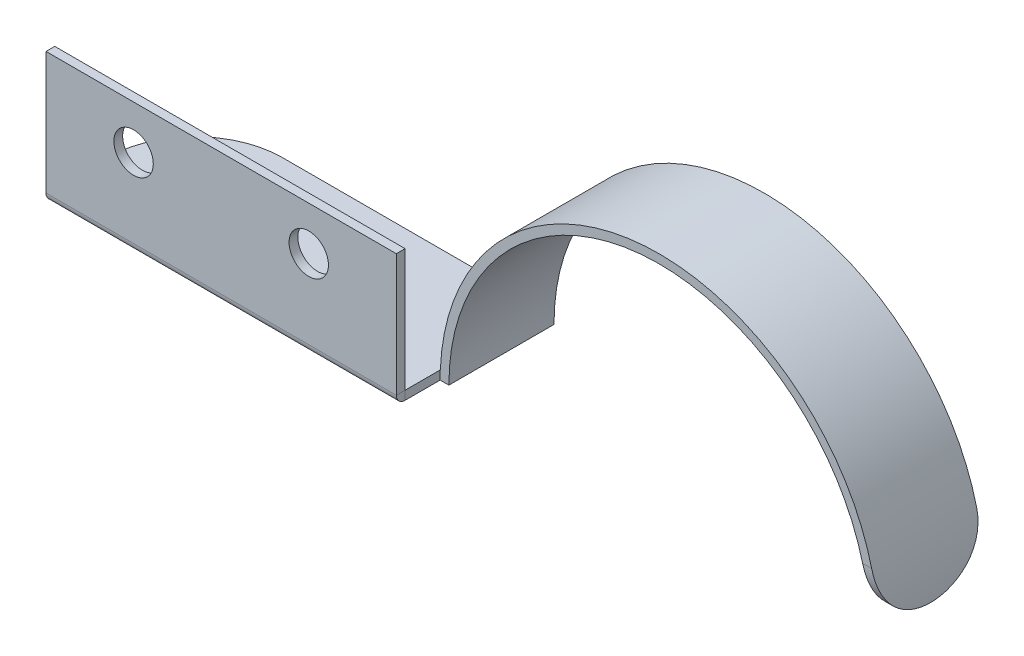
ISO-10303-21;
HEADER;
FILE_DESCRIPTION(('STEP AP214'),'2;1');
FILE_NAME('part.step','',(''),(''),'','','');
FILE_SCHEMA(('AUTOMOTIVE_DESIGN { 1 0 10303 214 1 1 1 1 }'));
ENDSEC;
DATA;
#1=APPLICATION_CONTEXT('core data for automotive mechanical design processes');
#2=APPLICATION_PROTOCOL_DEFINITION('international standard','automotive_design',2000,#1);
#3=PRODUCT_CONTEXT('',#1,'mechanical');
#4=PRODUCT('Part','Part','',(#3));
#5=PRODUCT_RELATED_PRODUCT_CATEGORY('part','',(#4));
#6=PRODUCT_DEFINITION_FORMATION('','',#4);
#7=PRODUCT_DEFINITION_CONTEXT('part definition',#1,'design');
#8=PRODUCT_DEFINITION('design','',#6,#7);
#9=PRODUCT_DEFINITION_SHAPE('','',#8);
#10=(LENGTH_UNIT() NAMED_UNIT(*) SI_UNIT(.MILLI.,.METRE.));
#11=(NAMED_UNIT(*) PLANE_ANGLE_UNIT() SI_UNIT($,.RADIAN.));
#12=(NAMED_UNIT(*) SI_UNIT($,.STERADIAN.) SOLID_ANGLE_UNIT());
#13=UNCERTAINTY_MEASURE_WITH_UNIT(LENGTH_MEASURE(1.E-05),#10,'distance_accuracy_value','');
#14=(GEOMETRIC_REPRESENTATION_CONTEXT(3) GLOBAL_UNCERTAINTY_ASSIGNED_CONTEXT((#13)) GLOBAL_UNIT_ASSIGNED_CONTEXT((#10,
#11,#12)) REPRESENTATION_CONTEXT('',''));
#15=CARTESIAN_POINT('',(0.,0.,0.));
#16=DIRECTION('',(0.,0.,1.));
#17=DIRECTION('',(1.,0.,0.));
#18=AXIS2_PLACEMENT_3D('',#15,#16,#17);
#19=CARTESIAN_POINT('',(65.,0.,-18.));
#20=DIRECTION('',(0.,0.,-1.));
#21=DIRECTION('',(-1.,0.,0.));
#22=AXIS2_PLACEMENT_3D('',#19,#20,#21);
#23=CYLINDRICAL_SURFACE('',#22,24.);
#24=CARTESIAN_POINT('',(65.,0.,-30.));
#25=DIRECTION('',(0.,0.,-1.));
#26=DIRECTION('',(-1.,0.,0.));
#27=AXIS2_PLACEMENT_3D('',#24,#25,#26);
#28=CIRCLE('',#27,24.);
#29=CARTESIAN_POINT('',(41.,0.,-30.));
#30=VERTEX_POINT('',#29);
#31=CARTESIAN_POINT('',(88.2379000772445,6.,-30.));
#32=VERTEX_POINT('',#31);
#33=EDGE_CURVE('E146',#30,#32,#28,.T.);
#34=ORIENTED_EDGE('',*,*,#33,.T.);
#35=CARTESIAN_POINT('',(88.2379000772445,6.,-18.));
#36=CARTESIAN_POINT('',(88.2799795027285,5.83709419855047,-17.9999809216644));
#37=CARTESIAN_POINT('',(88.3203173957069,5.6737241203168,-18.0066342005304));
#38=CARTESIAN_POINT('',(88.3973374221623,5.34719817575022,-18.0333738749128));
#39=CARTESIAN_POINT('',(88.4340190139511,5.18404234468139,-18.0534622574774));
#40=CARTESIAN_POINT('',(88.5035331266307,4.85917422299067,-18.1071543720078));
#41=CARTESIAN_POINT('',(88.5363665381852,4.69746160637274,-18.140754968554));
#42=CARTESIAN_POINT('',(88.5981223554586,4.37667508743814,-18.2214048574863));
#43=CARTESIAN_POINT('',(88.6270450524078,4.21760098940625,-18.2684531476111));
#44=CARTESIAN_POINT('',(88.6810319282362,3.90310418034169,-18.3758843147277));
#45=CARTESIAN_POINT('',(88.7060909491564,3.7476865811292,-18.4362847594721));
#46=CARTESIAN_POINT('',(88.7524163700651,3.4418949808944,-18.570086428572));
#47=CARTESIAN_POINT('',(88.7736813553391,3.29152287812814,-18.6434924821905));
#48=CARTESIAN_POINT('',(88.8125776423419,2.99719357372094,-18.8027764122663));
#49=CARTESIAN_POINT('',(88.8302116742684,2.85323161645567,-18.8886448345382));
#50=CARTESIAN_POINT('',(88.862123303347,2.57274151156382,-19.0723228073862));
#51=CARTESIAN_POINT('',(88.8764008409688,2.4362134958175,-19.1701325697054));
#52=CARTESIAN_POINT('',(88.9017090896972,2.1737990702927,-19.3753397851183));
#53=CARTESIAN_POINT('',(88.912788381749,2.04777670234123,-19.4825574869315));
#54=CARTESIAN_POINT('',(88.9323448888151,1.80491356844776,-19.7071448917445));
#55=CARTESIAN_POINT('',(88.9408221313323,1.68807270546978,-19.8245144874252));
#56=CARTESIAN_POINT('',(88.9555458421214,1.46437633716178,-20.0686462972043));
#57=CARTESIAN_POINT('',(88.9617912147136,1.35752575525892,-20.1954130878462));
#58=CARTESIAN_POINT('',(88.9724239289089,1.15464831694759,-20.4573997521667));
#59=CARTESIAN_POINT('',(88.9768112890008,1.0586213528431,-20.5926195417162));
#60=CARTESIAN_POINT('',(88.9841275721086,0.877442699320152,-20.8715412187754));
#61=CARTESIAN_POINT('',(88.987046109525,0.792371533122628,-21.0152956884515));
#62=CARTESIAN_POINT('',(88.9917403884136,0.634529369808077,-21.3093562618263));
#63=CARTESIAN_POINT('',(88.9935165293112,0.561754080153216,-21.4596600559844));
#64=CARTESIAN_POINT('',(88.9962569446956,0.429024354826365,-21.7657152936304));
#65=CARTESIAN_POINT('',(88.9972217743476,0.36906117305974,-21.9214629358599));
#66=CARTESIAN_POINT('',(88.9986254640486,0.262324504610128,-22.2373642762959));
#67=CARTESIAN_POINT('',(88.9990644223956,0.215548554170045,-22.3975171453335));
#68=CARTESIAN_POINT('',(88.9997853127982,0.117314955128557,-22.7947030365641));
#69=CARTESIAN_POINT('',(88.9999055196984,0.07337029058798,-23.0336346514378));
#70=CARTESIAN_POINT('',(89.000013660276,0.0147139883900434,-23.5150680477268));
#71=CARTESIAN_POINT('',(89.0000015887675,3.49687230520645E-06,-23.7575699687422));
#72=CARTESIAN_POINT('',(88.9999988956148,-2.43074844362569E-06,-24.1685181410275));
#73=CARTESIAN_POINT('',(89.000002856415,0.0071014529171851,-24.3370015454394));
#74=CARTESIAN_POINT('',(88.9999782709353,0.0354635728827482,-24.672824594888));
#75=CARTESIAN_POINT('',(88.9999497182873,0.0567245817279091,-24.840164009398));
#76=CARTESIAN_POINT('',(88.9997492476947,0.113272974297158,-25.1725560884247));
#77=CARTESIAN_POINT('',(88.9995772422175,0.148568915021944,-25.337607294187));
#78=CARTESIAN_POINT('',(88.998906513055,0.232950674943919,-25.6642109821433));
#79=CARTESIAN_POINT('',(88.9984076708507,0.282041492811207,-25.8257621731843));
#80=CARTESIAN_POINT('',(88.9968366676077,0.393621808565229,-26.1440486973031));
#81=CARTESIAN_POINT('',(88.9957648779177,0.456102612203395,-26.3007870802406));
#82=CARTESIAN_POINT('',(88.9927457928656,0.594060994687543,-26.6084983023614));
#83=CARTESIAN_POINT('',(88.99079816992,0.669543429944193,-26.7594689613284));
#84=CARTESIAN_POINT('',(88.9856821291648,0.832900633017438,-27.0544212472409));
#85=CARTESIAN_POINT('',(88.9825143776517,0.920768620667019,-27.1984066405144));
#86=CARTESIAN_POINT('',(88.9745784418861,1.10833174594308,-27.4785058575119));
#87=CARTESIAN_POINT('',(88.9698095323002,1.20803223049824,-27.6146160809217));
#88=CARTESIAN_POINT('',(88.9582905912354,1.41822340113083,-27.8775742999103));
#89=CARTESIAN_POINT('',(88.9515456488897,1.52868588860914,-28.004445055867));
#90=CARTESIAN_POINT('',(88.9356790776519,1.75973440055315,-28.2483350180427));
#91=CARTESIAN_POINT('',(88.9265585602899,1.88031567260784,-28.3653587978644));
#92=CARTESIAN_POINT('',(88.905556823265,2.13076123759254,-28.5888082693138));
#93=CARTESIAN_POINT('',(88.8936749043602,2.26062787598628,-28.6952312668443));
#94=CARTESIAN_POINT('',(88.8668075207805,2.5285597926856,-28.8966499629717));
#95=CARTESIAN_POINT('',(88.8518232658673,2.66662186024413,-28.9916500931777));
#96=CARTESIAN_POINT('',(88.8186181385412,2.94844880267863,-29.1686983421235));
#97=CARTESIAN_POINT('',(88.8004321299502,3.0921404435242,-29.2508695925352));
#98=CARTESIAN_POINT('',(88.7604960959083,3.38536727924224,-29.4028658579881));
#99=CARTESIAN_POINT('',(88.7387473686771,3.53490033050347,-29.4726953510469));
#100=CARTESIAN_POINT('',(88.6915123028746,3.83873293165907,-29.5996454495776));
#101=CARTESIAN_POINT('',(88.666025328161,3.99303328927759,-29.65676388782));
#102=CARTESIAN_POINT('',(88.6112482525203,4.30512329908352,-29.757979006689));
#103=CARTESIAN_POINT('',(88.5819588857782,4.46291227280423,-29.8020781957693));
#104=CARTESIAN_POINT('',(88.5061373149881,4.8492272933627,-29.8932319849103));
#105=CARTESIAN_POINT('',(88.4576014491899,5.07903474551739,-29.9334248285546));
#106=CARTESIAN_POINT('',(88.3792521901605,5.42444021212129,-29.9734562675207));
#107=CARTESIAN_POINT('',(88.3522318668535,5.53961219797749,-29.9834238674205));
#108=CARTESIAN_POINT('',(88.2963960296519,5.76991986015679,-29.9966952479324));
#109=CARTESIAN_POINT('',(88.2675803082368,5.88505553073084,-29.9999982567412));
#110=CARTESIAN_POINT('',(88.2379000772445,6.,-30.));
#111=B_SPLINE_CURVE_WITH_KNOTS('',3,(#35,#36,#37,#38,#39,#40,#41,#42,#43,#44,#45,#46,#47,#48,
#49,#50,#51,#52,#53,#54,#55,#56,#57,#58,#59,#60,#61,#62,#63,#64,#65,#66,#67,#68,#69,#70,#71,#72,
#73,#74,#75,#76,#77,#78,#79,#80,#81,#82,#83,#84,#85,#86,#87,#88,#89,#90,#91,#92,#93,#94,#95,#96,
#97,#98,#99,#100,#101,#102,#103,#104,#105,#106,#107,#108,#109,#110),.UNSPECIFIED.,.F.,.F.,(4,2,
2,2,2,2,2,2,2,2,2,2,2,2,2,2,2,2,2,2,2,2,2,2,2,2,2,2,2,2,2,2,2,2,2,2,2,4),(0.,0.504637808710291,
1.00935026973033,1.51394568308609,2.01850349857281,2.52372916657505,3.02914283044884,
3.53417506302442,4.03921625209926,4.53612484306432,5.03302818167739,5.53017512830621,
6.02731712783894,6.52792654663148,7.028360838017,7.52845241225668,8.02845049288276,
8.75541069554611,9.48239939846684,9.98774431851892,10.4931882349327,10.9989407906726,
11.5048768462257,12.0104853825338,12.516283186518,13.0218051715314,13.5275564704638,
14.0320165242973,14.5362409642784,15.0405932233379,15.5447491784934,16.0437212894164,
16.5425119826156,17.0413876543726,17.5401671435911,18.2531169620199,18.6091060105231,
18.9651362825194),.UNSPECIFIED.);
#112=CARTESIAN_POINT('',(88.2379000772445,6.,-18.));
#113=VERTEX_POINT('',#112);
#114=EDGE_CURVE('E133',#113,#32,#111,.T.);
#115=ORIENTED_EDGE('',*,*,#114,.F.);
#116=CARTESIAN_POINT('',(65.,0.,-18.));
#117=DIRECTION('',(0.,0.,-1.));
#118=DIRECTION('',(-1.,0.,0.));
#119=AXIS2_PLACEMENT_3D('',#116,#117,#118);
#120=CIRCLE('',#119,24.);
#121=CARTESIAN_POINT('',(41.,0.,-18.));
#122=VERTEX_POINT('',#121);
#123=EDGE_CURVE('E257',#122,#113,#120,.T.);
#124=ORIENTED_EDGE('',*,*,#123,.F.);
#125=DIRECTION('',(0.,0.,-1.));
#126=VECTOR('',#125,1.);
#127=CARTESIAN_POINT('',(41.,0.,-18.));
#128=LINE('',#127,#126);
#129=EDGE_CURVE('E150',#122,#30,#128,.T.);
#130=ORIENTED_EDGE('',*,*,#129,.T.);
#131=EDGE_LOOP('',(#34,#115,#124,#130));
#132=FACE_BOUND('',#131,.T.);
#133=ADVANCED_FACE('F40',(#132),#23,.F.);
#134=CARTESIAN_POINT('',(65.,0.,-18.));
#135=DIRECTION('',(0.,0.,-1.));
#136=DIRECTION('',(-1.,0.,0.));
#137=AXIS2_PLACEMENT_3D('',#134,#135,#136);
#138=CYLINDRICAL_SURFACE('',#137,25.);
#139=CARTESIAN_POINT('',(89.2693221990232,6.,-18.));
#140=CARTESIAN_POINT('',(89.3097277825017,5.83663145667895,-17.9999809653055));
#141=CARTESIAN_POINT('',(89.3484559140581,5.67283487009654,-18.0066719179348));
#142=CARTESIAN_POINT('',(89.4223916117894,5.34553304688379,-18.0335455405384));
#143=CARTESIAN_POINT('',(89.4575987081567,5.18202785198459,-18.0537300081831));
#144=CARTESIAN_POINT('',(89.5243068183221,4.85654430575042,-18.1076551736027));
#145=CARTESIAN_POINT('',(89.5558088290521,4.69456555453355,-18.1413922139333));
#146=CARTESIAN_POINT('',(89.615051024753,4.37331960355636,-18.2223410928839));
#147=CARTESIAN_POINT('',(89.6427914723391,4.21405221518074,-18.2695519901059));
#148=CARTESIAN_POINT('',(89.6945610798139,3.89924817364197,-18.377317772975));
#149=CARTESIAN_POINT('',(89.7185855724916,3.74371641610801,-18.4378892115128));
#150=CARTESIAN_POINT('',(89.7629915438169,3.43775460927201,-18.5720344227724));
#151=CARTESIAN_POINT('',(89.7833716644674,3.28732647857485,-18.6456130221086));
#152=CARTESIAN_POINT('',(89.8206410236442,2.99295418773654,-18.8052253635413));
#153=CARTESIAN_POINT('',(89.8375333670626,2.8490043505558,-18.8912479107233));
#154=CARTESIAN_POINT('',(89.8681034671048,2.56852893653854,-19.0752516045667));
#155=CARTESIAN_POINT('',(89.8817801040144,2.4320059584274,-19.1732368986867));
#156=CARTESIAN_POINT('',(89.906031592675,2.16949491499,-19.3788947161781));
#157=CARTESIAN_POINT('',(89.9166500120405,2.04337926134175,-19.4863993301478));
#158=CARTESIAN_POINT('',(89.935386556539,1.80037540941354,-19.7115746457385));
#159=CARTESIAN_POINT('',(89.9435046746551,1.68348723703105,-19.8292453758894));
#160=CARTESIAN_POINT('',(89.957599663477,1.45972542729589,-20.0740072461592));
#161=CARTESIAN_POINT('',(89.9635751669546,1.35285821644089,-20.2011043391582));
#162=CARTESIAN_POINT('',(89.973741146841,1.15002799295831,-20.4637181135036));
#163=CARTESIAN_POINT('',(89.9779322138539,1.05406138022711,-20.5992319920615));
#164=CARTESIAN_POINT('',(89.98491564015,0.873069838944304,-20.8787042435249));
#165=CARTESIAN_POINT('',(89.9876984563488,0.788122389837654,-21.0227130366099));
#166=CARTESIAN_POINT('',(89.9921708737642,0.630560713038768,-21.3172752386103));
#167=CARTESIAN_POINT('',(89.9938608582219,0.557942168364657,-21.4678263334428));
#168=CARTESIAN_POINT('',(89.9964654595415,0.425559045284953,-21.774363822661));
#169=CARTESIAN_POINT('',(89.9973806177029,0.365785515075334,-21.9303463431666));
#170=CARTESIAN_POINT('',(89.9987099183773,0.259459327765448,-22.2467038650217));
#171=CARTESIAN_POINT('',(89.9991241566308,0.212904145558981,-22.4070780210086));
#172=CARTESIAN_POINT('',(89.9997995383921,0.115700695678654,-22.8029461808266));
#173=CARTESIAN_POINT('',(89.9999117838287,0.0723601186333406,-23.0402728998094));
#174=CARTESIAN_POINT('',(90.0000127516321,0.0145109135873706,-23.5184227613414));
#175=CARTESIAN_POINT('',(90.0000014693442,3.37208022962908E-06,-23.7592460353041));
#176=CARTESIAN_POINT('',(89.9999989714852,-2.36039619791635E-06,-24.1685234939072));
#177=CARTESIAN_POINT('',(90.0000027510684,0.00710196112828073,-24.3370130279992));
#178=CARTESIAN_POINT('',(89.9999791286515,0.0354660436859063,-24.6728483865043));
#179=CARTESIAN_POINT('',(89.9999517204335,0.056728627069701,-24.8401939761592));
#180=CARTESIAN_POINT('',(89.9997592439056,0.113281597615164,-25.1726005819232));
#181=CARTESIAN_POINT('',(89.9995940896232,0.148580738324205,-25.3376601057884));
#182=CARTESIAN_POINT('',(89.9989500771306,0.232970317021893,-25.6642799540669));
#183=CARTESIAN_POINT('',(89.998471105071,0.282065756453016,-25.8258389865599));
#184=CARTESIAN_POINT('',(89.9969626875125,0.39365600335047,-26.1441386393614));
#185=CARTESIAN_POINT('',(89.995933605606,0.456141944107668,-26.300882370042));
#186=CARTESIAN_POINT('',(89.993034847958,0.594111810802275,-26.608604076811));
#187=CARTESIAN_POINT('',(89.9911648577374,0.66960059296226,-26.7595798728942));
#188=CARTESIAN_POINT('',(89.9862528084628,0.832971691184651,-27.0545418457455));
#189=CARTESIAN_POINT('',(89.9832113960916,0.920847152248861,-27.1985318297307));
#190=CARTESIAN_POINT('',(89.9755920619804,1.1084278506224,-27.4786414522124));
#191=CARTESIAN_POINT('',(89.9710134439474,1.2081384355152,-27.6147574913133));
#192=CARTESIAN_POINT('',(89.9599531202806,1.41837599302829,-27.8777566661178));
#193=CARTESIAN_POINT('',(89.9534759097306,1.52887701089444,-28.0046607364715));
#194=CARTESIAN_POINT('',(89.9382387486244,1.76001466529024,-28.2486169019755));
#195=CARTESIAN_POINT('',(89.9294798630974,1.88064655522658,-28.365673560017));
#196=CARTESIAN_POINT('',(89.9093101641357,2.13121194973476,-28.5891907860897));
#197=CARTESIAN_POINT('',(89.8978986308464,2.26114797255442,-28.6956484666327));
#198=CARTESIAN_POINT('',(89.8720940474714,2.5292412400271,-28.8971359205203));
#199=CARTESIAN_POINT('',(89.8577021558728,2.66739527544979,-28.9921701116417));
#200=CARTESIAN_POINT('',(89.8257949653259,2.94955369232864,-29.1693584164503));
#201=CARTESIAN_POINT('',(89.8083104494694,3.09349049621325,-29.2516257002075));
#202=CARTESIAN_POINT('',(89.7699100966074,3.38725386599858,-29.4037868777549));
#203=CARTESIAN_POINT('',(89.7489955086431,3.5370782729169,-29.4736852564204));
#204=CARTESIAN_POINT('',(89.7035674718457,3.84154047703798,-29.600737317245));
#205=CARTESIAN_POINT('',(89.6790535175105,3.99617894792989,-29.657889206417));
#206=CARTESIAN_POINT('',(89.6263619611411,4.30900042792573,-29.7591288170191));
#207=CARTESIAN_POINT('',(89.5981850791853,4.46718273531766,-29.8032191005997));
#208=CARTESIAN_POINT('',(89.5255158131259,4.85304070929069,-29.8939380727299));
#209=CARTESIAN_POINT('',(89.4791420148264,5.08199424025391,-29.9338521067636));
#210=CARTESIAN_POINT('',(89.4043040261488,5.42621207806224,-29.9736188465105));
#211=CARTESIAN_POINT('',(89.3784977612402,5.54100452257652,-29.9835237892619));
#212=CARTESIAN_POINT('',(89.3251762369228,5.77058860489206,-29.9967139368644));
#213=CARTESIAN_POINT('',(89.2976607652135,5.88538024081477,-29.9999983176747));
#214=CARTESIAN_POINT('',(89.2693221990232,6.,-30.));
#215=B_SPLINE_CURVE_WITH_KNOTS('',3,(#139,#140,#141,#142,#143,#144,#145,#146,#147,#148,#149,
#150,#151,#152,#153,#154,#155,#156,#157,#158,#159,#160,#161,#162,#163,#164,#165,#166,#167,#168,
#169,#170,#171,#172,#173,#174,#175,#176,#177,#178,#179,#180,#181,#182,#183,#184,#185,#186,#187,
#188,#189,#190,#191,#192,#193,#194,#195,#196,#197,#198,#199,#200,#201,#202,#203,#204,#205,#206,
#207,#208,#209,#210,#211,#212,#213,#214),.UNSPECIFIED.,.F.,.F.,(4,2,2,2,2,2,2,2,2,2,2,2,2,2,2,2,
2,2,2,2,2,2,2,2,2,2,2,2,2,2,2,2,2,2,2,2,2,4),(0.,0.504750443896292,1.00956814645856,
1.51424970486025,2.01889601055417,2.5241710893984,3.02963405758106,3.53464509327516,
4.03983171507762,4.53741836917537,5.03500641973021,5.5329114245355,6.03065150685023,
6.53172083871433,7.03261435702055,7.53315765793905,8.03360527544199,8.75554256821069,
9.47750706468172,9.98286937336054,10.4883324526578,10.9941112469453,11.5000736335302,
12.0057020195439,12.5115196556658,13.0170584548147,13.5228265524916,14.0274067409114,
14.5317518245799,15.0362339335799,15.5405203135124,16.0400439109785,16.5393860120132,
17.0387983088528,17.5381125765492,18.2471859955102,18.6012429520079,18.9553439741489),.UNSPECIFIED.);
#216=CARTESIAN_POINT('',(89.2693221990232,6.,-18.));
#217=VERTEX_POINT('',#216);
#218=CARTESIAN_POINT('',(89.2693221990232,6.,-30.));
#219=VERTEX_POINT('',#218);
#220=EDGE_CURVE('E54',#217,#219,#215,.T.);
#221=ORIENTED_EDGE('',*,*,#220,.T.);
#222=CARTESIAN_POINT('',(65.,0.,-30.));
#223=DIRECTION('',(0.,0.,-1.));
#224=DIRECTION('',(-1.,0.,0.));
#225=AXIS2_PLACEMENT_3D('',#222,#223,#224);
#226=CIRCLE('',#225,25.);
#227=CARTESIAN_POINT('',(40.0200080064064,1.,-30.));
#228=VERTEX_POINT('',#227);
#229=EDGE_CURVE('E141',#228,#219,#226,.T.);
#230=ORIENTED_EDGE('',*,*,#229,.F.);
#231=DIRECTION('',(0.,0.,-1.));
#232=VECTOR('',#231,1.);
#233=CARTESIAN_POINT('',(40.0200080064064,1.,-18.));
#234=LINE('',#233,#232);
#235=CARTESIAN_POINT('',(40.0200080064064,1.,-18.));
#236=VERTEX_POINT('',#235);
#237=EDGE_CURVE('E161',#236,#228,#234,.T.);
#238=ORIENTED_EDGE('',*,*,#237,.F.);
#239=CARTESIAN_POINT('',(65.,0.,-18.));
#240=DIRECTION('',(0.,0.,-1.));
#241=DIRECTION('',(-1.,0.,0.));
#242=AXIS2_PLACEMENT_3D('',#239,#240,#241);
#243=CIRCLE('',#242,25.);
#244=EDGE_CURVE('E154',#236,#217,#243,.T.);
#245=ORIENTED_EDGE('',*,*,#244,.T.);
#246=EDGE_LOOP('',(#221,#230,#238,#245));
#247=FACE_BOUND('',#246,.T.);
#248=ADVANCED_FACE('F259',(#247),#138,.T.);
#249=CARTESIAN_POINT('',(10.0000000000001,1.,-30.));
#250=DIRECTION('',(0.,0.,1.));
#251=DIRECTION('',(1.,0.,0.));
#252=AXIS2_PLACEMENT_3D('',#249,#250,#251);
#253=PLANE('',#252);
#254=DIRECTION('',(1.,0.,0.));
#255=VECTOR('',#254,1.);
#256=CARTESIAN_POINT('',(80.,6.,-30.));
#257=LINE('',#256,#255);
#258=EDGE_CURVE('E12',#32,#219,#257,.T.);
#259=ORIENTED_EDGE('',*,*,#258,.F.);
#260=ORIENTED_EDGE('',*,*,#33,.F.);
#261=DIRECTION('',(-1.,0.,0.));
#262=VECTOR('',#261,1.);
#263=CARTESIAN_POINT('',(10.0000000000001,0.,-30.));
#264=LINE('',#263,#262);
#265=CARTESIAN_POINT('',(10.0000000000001,0.,-30.));
#266=VERTEX_POINT('',#265);
#267=EDGE_CURVE('E203',#30,#266,#264,.T.);
#268=ORIENTED_EDGE('',*,*,#267,.T.);
#269=DIRECTION('',(0.,-1.,0.));
#270=VECTOR('',#269,1.);
#271=CARTESIAN_POINT('',(10.0000000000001,1.,-30.));
#272=LINE('',#271,#270);
#273=CARTESIAN_POINT('',(10.0000000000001,1.,-30.));
#274=VERTEX_POINT('',#273);
#275=EDGE_CURVE('E205',#274,#266,#272,.T.);
#276=ORIENTED_EDGE('',*,*,#275,.F.);
#277=DIRECTION('',(-1.,0.,0.));
#278=VECTOR('',#277,1.);
#279=CARTESIAN_POINT('',(10.0000000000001,1.,-30.));
#280=LINE('',#279,#278);
#281=EDGE_CURVE('E193',#228,#274,#280,.T.);
#282=ORIENTED_EDGE('',*,*,#281,.F.);
#283=ORIENTED_EDGE('',*,*,#229,.T.);
#284=EDGE_LOOP('',(#259,#260,#268,#276,#282,#283));
#285=FACE_BOUND('',#284,.T.);
#286=ADVANCED_FACE('F145',(#285),#253,.F.);
#287=CARTESIAN_POINT('',(40.,1.,0.));
#288=DIRECTION('',(-1.,0.,0.));
#289=DIRECTION('',(0.,0.,1.));
#290=AXIS2_PLACEMENT_3D('',#287,#288,#289);
#291=PLANE('',#290);
#292=DIRECTION('',(0.,-1.,0.));
#293=VECTOR('',#292,1.);
#294=CARTESIAN_POINT('',(40.,2.55162453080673,-18.));
#295=LINE('',#294,#293);
#296=CARTESIAN_POINT('',(40.,1.,-18.));
#297=VERTEX_POINT('',#296);
#298=CARTESIAN_POINT('',(40.,0.,-18.));
#299=VERTEX_POINT('',#298);
#300=EDGE_CURVE('E62',#297,#299,#295,.T.);
#301=ORIENTED_EDGE('',*,*,#300,.F.);
#302=DIRECTION('',(0.,0.,-1.));
#303=VECTOR('',#302,1.);
#304=CARTESIAN_POINT('',(40.,1.,0.));
#305=LINE('',#304,#303);
#306=CARTESIAN_POINT('',(40.,1.,-14.));
#307=VERTEX_POINT('',#306);
#308=EDGE_CURVE('E195',#307,#297,#305,.T.);
#309=ORIENTED_EDGE('',*,*,#308,.F.);
#310=DIRECTION('',(0.,-1.,0.));
#311=VECTOR('',#310,1.);
#312=CARTESIAN_POINT('',(40.,0.999999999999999,-14.));
#313=LINE('',#312,#311);
#314=CARTESIAN_POINT('',(40.,0.,-14.));
#315=VERTEX_POINT('',#314);
#316=EDGE_CURVE('E188',#307,#315,#313,.T.);
#317=ORIENTED_EDGE('',*,*,#316,.T.);
#318=DIRECTION('',(0.,0.,-1.));
#319=VECTOR('',#318,1.);
#320=CARTESIAN_POINT('',(40.,0.,0.));
#321=LINE('',#320,#319);
#322=EDGE_CURVE('E186',#315,#299,#321,.T.);
#323=ORIENTED_EDGE('',*,*,#322,.T.);
#324=EDGE_LOOP('',(#301,#309,#317,#323));
#325=FACE_BOUND('',#324,.T.);
#326=ADVANCED_FACE('F280',(#325),#291,.F.);
#327=CARTESIAN_POINT('',(10.,-5.00007278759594,-12.9999));
#328=DIRECTION('',(0.,0.,1.));
#329=DIRECTION('',(0.,-1.,0.));
#330=AXIS2_PLACEMENT_3D('',#327,#328,#329);
#331=PLANE('',#330);
#332=CARTESIAN_POINT('',(10.,9.99992721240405,-12.9999));
#333=DIRECTION('',(0.,0.,-1.));
#334=DIRECTION('',(0.,1.,0.));
#335=AXIS2_PLACEMENT_3D('',#332,#333,#334);
#336=CIRCLE('',#335,2.25);
#337=CARTESIAN_POINT('',(10.,12.2499272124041,-12.9999));
#338=VERTEX_POINT('',#337);
#339=EDGE_CURVE('E214',#338,#338,#336,.T.);
#340=ORIENTED_EDGE('',*,*,#339,.T.);
#341=EDGE_LOOP('',(#340));
#342=FACE_BOUND('',#341,.T.);
#343=CARTESIAN_POINT('',(30.,9.99992721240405,-12.9999));
#344=DIRECTION('',(0.,0.,-1.));
#345=DIRECTION('',(0.,1.,0.));
#346=AXIS2_PLACEMENT_3D('',#343,#344,#345);
#347=CIRCLE('',#346,2.25);
#348=CARTESIAN_POINT('',(30.,12.2499272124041,-12.9999));
#349=VERTEX_POINT('',#348);
#350=EDGE_CURVE('E179',#349,#349,#347,.T.);
#351=ORIENTED_EDGE('',*,*,#350,.T.);
#352=EDGE_LOOP('',(#351));
#353=FACE_BOUND('',#352,.T.);
#354=DIRECTION('',(0.,1.,0.));
#355=VECTOR('',#354,1.);
#356=CARTESIAN_POINT('',(0.,14.9999272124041,-12.9999));
#357=LINE('',#356,#355);
#358=CARTESIAN_POINT('',(0.,1.00010000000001,-12.9999));
#359=VERTEX_POINT('',#358);
#360=CARTESIAN_POINT('',(0.,14.9999272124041,-12.9999));
#361=VERTEX_POINT('',#360);
#362=EDGE_CURVE('E220',#359,#361,#357,.T.);
#363=ORIENTED_EDGE('',*,*,#362,.F.);
#364=DIRECTION('',(1.,0.,0.));
#365=VECTOR('',#364,1.);
#366=CARTESIAN_POINT('',(10.,1.0001,-12.9999));
#367=LINE('',#366,#365);
#368=CARTESIAN_POINT('',(40.,1.0001,-12.9999));
#369=VERTEX_POINT('',#368);
#370=EDGE_CURVE('E242',#359,#369,#367,.T.);
#371=ORIENTED_EDGE('',*,*,#370,.T.);
#372=DIRECTION('',(0.,-1.,0.));
#373=VECTOR('',#372,1.);
#374=CARTESIAN_POINT('',(40.,14.9999272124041,-12.9999));
#375=LINE('',#374,#373);
#376=CARTESIAN_POINT('',(40.,14.9999272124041,-12.9999));
#377=VERTEX_POINT('',#376);
#378=EDGE_CURVE('E229',#377,#369,#375,.T.);
#379=ORIENTED_EDGE('',*,*,#378,.F.);
#380=DIRECTION('',(1.,0.,0.));
#381=VECTOR('',#380,1.);
#382=CARTESIAN_POINT('',(0.,14.9999272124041,-12.9999));
#383=LINE('',#382,#381);
#384=EDGE_CURVE('E227',#361,#377,#383,.T.);
#385=ORIENTED_EDGE('',*,*,#384,.F.);
#386=EDGE_LOOP('',(#363,#371,#379,#385));
#387=FACE_BOUND('',#386,.T.);
#388=ADVANCED_FACE('F355',(#342,#353,#387),#331,.T.);
#389=CARTESIAN_POINT('',(10.,-5.00007278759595,-13.9999));
#390=DIRECTION('',(0.,0.,1.));
#391=DIRECTION('',(0.,-1.,0.));
#392=AXIS2_PLACEMENT_3D('',#389,#390,#391);
#393=PLANE('',#392);
#394=DIRECTION('',(1.,0.,0.));
#395=VECTOR('',#394,1.);
#396=CARTESIAN_POINT('',(10.,1.0001,-13.9999));
#397=LINE('',#396,#395);
#398=CARTESIAN_POINT('',(0.,1.0001,-13.9999));
#399=VERTEX_POINT('',#398);
#400=CARTESIAN_POINT('',(40.,1.0001,-13.9999));
#401=VERTEX_POINT('',#400);
#402=EDGE_CURVE('E236',#399,#401,#397,.T.);
#403=ORIENTED_EDGE('',*,*,#402,.F.);
#404=DIRECTION('',(0.,1.,0.));
#405=VECTOR('',#404,1.);
#406=CARTESIAN_POINT('',(0.,14.9999272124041,-13.9999000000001));
#407=LINE('',#406,#405);
#408=CARTESIAN_POINT('',(0.,14.9999272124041,-13.9999000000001));
#409=VERTEX_POINT('',#408);
#410=EDGE_CURVE('E226',#399,#409,#407,.T.);
#411=ORIENTED_EDGE('',*,*,#410,.T.);
#412=DIRECTION('',(1.,0.,0.));
#413=VECTOR('',#412,1.);
#414=CARTESIAN_POINT('',(0.,14.9999272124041,-13.9999000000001));
#415=LINE('',#414,#413);
#416=CARTESIAN_POINT('',(40.,14.9999272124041,-13.9999000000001));
#417=VERTEX_POINT('',#416);
#418=EDGE_CURVE('E223',#409,#417,#415,.T.);
#419=ORIENTED_EDGE('',*,*,#418,.T.);
#420=DIRECTION('',(0.,-1.,0.));
#421=VECTOR('',#420,1.);
#422=CARTESIAN_POINT('',(40.,14.9999272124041,-13.9999000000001));
#423=LINE('',#422,#421);
#424=EDGE_CURVE('E225',#417,#401,#423,.T.);
#425=ORIENTED_EDGE('',*,*,#424,.T.);
#426=EDGE_LOOP('',(#403,#411,#419,#425));
#427=FACE_BOUND('',#426,.T.);
#428=CARTESIAN_POINT('',(10.,9.99992721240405,-13.9999));
#429=DIRECTION('',(0.,0.,-1.));
#430=DIRECTION('',(0.,1.,0.));
#431=AXIS2_PLACEMENT_3D('',#428,#429,#430);
#432=CIRCLE('',#431,2.25);
#433=CARTESIAN_POINT('',(10.,12.2499272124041,-13.9999));
#434=VERTEX_POINT('',#433);
#435=EDGE_CURVE('E217',#434,#434,#432,.T.);
#436=ORIENTED_EDGE('',*,*,#435,.F.);
#437=EDGE_LOOP('',(#436));
#438=FACE_BOUND('',#437,.T.);
#439=CARTESIAN_POINT('',(30.,9.99992721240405,-13.9999));
#440=DIRECTION('',(0.,0.,-1.));
#441=DIRECTION('',(0.,1.,0.));
#442=AXIS2_PLACEMENT_3D('',#439,#440,#441);
#443=CIRCLE('',#442,2.25);
#444=CARTESIAN_POINT('',(30.,12.2499272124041,-13.9999));
#445=VERTEX_POINT('',#444);
#446=EDGE_CURVE('E211',#445,#445,#443,.T.);
#447=ORIENTED_EDGE('',*,*,#446,.F.);
#448=EDGE_LOOP('',(#447));
#449=FACE_BOUND('',#448,.T.);
#450=ADVANCED_FACE('F289',(#427,#438,#449),#393,.F.);
#451=CARTESIAN_POINT('',(0.,14.9999272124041,-13.9999000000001));
#452=DIRECTION('',(1.,0.,0.));
#453=DIRECTION('',(0.,-1.,0.));
#454=AXIS2_PLACEMENT_3D('',#451,#452,#453);
#455=PLANE('',#454);
#456=DIRECTION('',(0.,0.,-1.));
#457=VECTOR('',#456,1.);
#458=CARTESIAN_POINT('',(0.,1.0001,-13.9999));
#459=LINE('',#458,#457);
#460=EDGE_CURVE('E245',#359,#399,#459,.T.);
#461=ORIENTED_EDGE('',*,*,#460,.F.);
#462=ORIENTED_EDGE('',*,*,#362,.T.);
#463=DIRECTION('',(0.,0.,1.));
#464=VECTOR('',#463,1.);
#465=CARTESIAN_POINT('',(0.,14.9999272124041,-13.9999000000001));
#466=LINE('',#465,#464);
#467=EDGE_CURVE('E233',#409,#361,#466,.T.);
#468=ORIENTED_EDGE('',*,*,#467,.F.);
#469=ORIENTED_EDGE('',*,*,#410,.F.);
#470=EDGE_LOOP('',(#461,#462,#468,#469));
#471=FACE_BOUND('',#470,.T.);
#472=ADVANCED_FACE('F42',(#471),#455,.F.);
#473=CARTESIAN_POINT('',(0.,14.9999272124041,-13.9999000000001));
#474=DIRECTION('',(0.,-1.,0.));
#475=DIRECTION('',(-1.,0.,0.));
#476=AXIS2_PLACEMENT_3D('',#473,#474,#475);
#477=PLANE('',#476);
#478=ORIENTED_EDGE('',*,*,#384,.T.);
#479=DIRECTION('',(0.,0.,1.));
#480=VECTOR('',#479,1.);
#481=CARTESIAN_POINT('',(40.,14.9999272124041,-13.9999000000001));
#482=LINE('',#481,#480);
#483=EDGE_CURVE('E230',#417,#377,#482,.T.);
#484=ORIENTED_EDGE('',*,*,#483,.F.);
#485=ORIENTED_EDGE('',*,*,#418,.F.);
#486=ORIENTED_EDGE('',*,*,#467,.T.);
#487=EDGE_LOOP('',(#478,#484,#485,#486));
#488=FACE_BOUND('',#487,.T.);
#489=ADVANCED_FACE('F369',(#488),#477,.F.);
#490=CARTESIAN_POINT('',(40.,14.9999272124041,-13.9999000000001));
#491=DIRECTION('',(-1.,0.,0.));
#492=DIRECTION('',(0.,1.,0.));
#493=AXIS2_PLACEMENT_3D('',#490,#491,#492);
#494=PLANE('',#493);
#495=DIRECTION('',(0.,0.,1.));
#496=VECTOR('',#495,1.);
#497=CARTESIAN_POINT('',(40.,1.0001,-13.9999));
#498=LINE('',#497,#496);
#499=EDGE_CURVE('E239',#401,#369,#498,.T.);
#500=ORIENTED_EDGE('',*,*,#499,.F.);
#501=ORIENTED_EDGE('',*,*,#424,.F.);
#502=ORIENTED_EDGE('',*,*,#483,.T.);
#503=ORIENTED_EDGE('',*,*,#378,.T.);
#504=EDGE_LOOP('',(#500,#501,#502,#503));
#505=FACE_BOUND('',#504,.T.);
#506=ADVANCED_FACE('F366',(#505),#494,.F.);
#507=CARTESIAN_POINT('',(10.,9.99992721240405,-13.9999));
#508=DIRECTION('',(0.,0.,1.));
#509=DIRECTION('',(0.,-1.,0.));
#510=AXIS2_PLACEMENT_3D('',#507,#508,#509);
#511=CYLINDRICAL_SURFACE('',#510,2.25);
#512=ORIENTED_EDGE('',*,*,#435,.T.);
#513=EDGE_LOOP('',(#512));
#514=FACE_BOUND('',#513,.T.);
#515=ORIENTED_EDGE('',*,*,#339,.F.);
#516=EDGE_LOOP('',(#515));
#517=FACE_BOUND('',#516,.T.);
#518=ADVANCED_FACE('F368',(#514,#517),#511,.F.);
#519=CARTESIAN_POINT('',(30.,9.99992721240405,-13.9999));
#520=DIRECTION('',(0.,0.,1.));
#521=DIRECTION('',(0.,-1.,0.));
#522=AXIS2_PLACEMENT_3D('',#519,#520,#521);
#523=CYLINDRICAL_SURFACE('',#522,2.25);
#524=ORIENTED_EDGE('',*,*,#446,.T.);
#525=EDGE_LOOP('',(#524));
#526=FACE_BOUND('',#525,.T.);
#527=ORIENTED_EDGE('',*,*,#350,.F.);
#528=EDGE_LOOP('',(#527));
#529=FACE_BOUND('',#528,.T.);
#530=ADVANCED_FACE('F349',(#526,#529),#523,.F.);
#531=CARTESIAN_POINT('',(10.,1.,-20.));
#532=DIRECTION('',(0.,-1.,0.));
#533=DIRECTION('',(0.,0.,-1.));
#534=AXIS2_PLACEMENT_3D('',#531,#532,#533);
#535=CYLINDRICAL_SURFACE('',#534,10.);
#536=CARTESIAN_POINT('',(10.,0.,-20.));
#537=DIRECTION('',(0.,1.,0.));
#538=DIRECTION('',(0.,0.,-1.));
#539=AXIS2_PLACEMENT_3D('',#536,#537,#538);
#540=CIRCLE('',#539,10.);
#541=CARTESIAN_POINT('',(0.,0.,-19.9999999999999));
#542=VERTEX_POINT('',#541);
#543=EDGE_CURVE('E208',#266,#542,#540,.T.);
#544=ORIENTED_EDGE('',*,*,#543,.T.);
#545=DIRECTION('',(0.,-1.,0.));
#546=VECTOR('',#545,1.);
#547=CARTESIAN_POINT('',(0.,1.,-19.9999999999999));
#548=LINE('',#547,#546);
#549=CARTESIAN_POINT('',(0.,1.,-19.9999999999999));
#550=VERTEX_POINT('',#549);
#551=EDGE_CURVE('E176',#550,#542,#548,.T.);
#552=ORIENTED_EDGE('',*,*,#551,.F.);
#553=CARTESIAN_POINT('',(10.,1.,-20.));
#554=DIRECTION('',(0.,1.,0.));
#555=DIRECTION('',(0.,0.,-1.));
#556=AXIS2_PLACEMENT_3D('',#553,#554,#555);
#557=CIRCLE('',#556,10.);
#558=EDGE_CURVE('E191',#274,#550,#557,.T.);
#559=ORIENTED_EDGE('',*,*,#558,.F.);
#560=ORIENTED_EDGE('',*,*,#275,.T.);
#561=EDGE_LOOP('',(#544,#552,#559,#560));
#562=FACE_BOUND('',#561,.T.);
#563=ADVANCED_FACE('F274',(#562),#535,.T.);
#564=CARTESIAN_POINT('',(10.,1.,-20.));
#565=DIRECTION('',(0.,-1.,0.));
#566=DIRECTION('',(0.,0.,-1.));
#567=AXIS2_PLACEMENT_3D('',#564,#565,#566);
#568=PLANE('',#567);
#569=DIRECTION('',(0.,0.,1.));
#570=VECTOR('',#569,1.);
#571=CARTESIAN_POINT('',(0.,1.,0.));
#572=LINE('',#571,#570);
#573=CARTESIAN_POINT('',(0.,1.,-14.));
#574=VERTEX_POINT('',#573);
#575=EDGE_CURVE('E200',#550,#574,#572,.T.);
#576=ORIENTED_EDGE('',*,*,#575,.T.);
#577=DIRECTION('',(1.,0.,0.));
#578=VECTOR('',#577,1.);
#579=CARTESIAN_POINT('',(10.,1.,-14.));
#580=LINE('',#579,#578);
#581=EDGE_CURVE('E197',#574,#307,#580,.T.);
#582=ORIENTED_EDGE('',*,*,#581,.T.);
#583=ORIENTED_EDGE('',*,*,#308,.T.);
#584=DIRECTION('',(1.,0.,0.));
#585=VECTOR('',#584,1.);
#586=CARTESIAN_POINT('',(-15.1833080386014,1.0000000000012,-18.));
#587=LINE('',#586,#585);
#588=EDGE_CURVE('E151',#297,#236,#587,.T.);
#589=ORIENTED_EDGE('',*,*,#588,.T.);
#590=ORIENTED_EDGE('',*,*,#237,.T.);
#591=ORIENTED_EDGE('',*,*,#281,.T.);
#592=ORIENTED_EDGE('',*,*,#558,.T.);
#593=EDGE_LOOP('',(#576,#582,#583,#589,#590,#591,#592));
#594=FACE_BOUND('',#593,.T.);
#595=ADVANCED_FACE('F278',(#594),#568,.F.);
#596=CARTESIAN_POINT('',(10.,0.,-20.));
#597=DIRECTION('',(0.,-1.,0.));
#598=DIRECTION('',(0.,0.,-1.));
#599=AXIS2_PLACEMENT_3D('',#596,#597,#598);
#600=PLANE('',#599);
#601=DIRECTION('',(1.,0.,0.));
#602=VECTOR('',#601,1.);
#603=CARTESIAN_POINT('',(10.,0.,-14.));
#604=LINE('',#603,#602);
#605=CARTESIAN_POINT('',(0.,0.,-13.9999999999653));
#606=VERTEX_POINT('',#605);
#607=EDGE_CURVE('E171',#606,#315,#604,.T.);
#608=ORIENTED_EDGE('',*,*,#607,.F.);
#609=DIRECTION('',(0.,0.,1.));
#610=VECTOR('',#609,1.);
#611=CARTESIAN_POINT('',(0.,0.,0.));
#612=LINE('',#611,#610);
#613=EDGE_CURVE('E183',#542,#606,#612,.T.);
#614=ORIENTED_EDGE('',*,*,#613,.F.);
#615=ORIENTED_EDGE('',*,*,#543,.F.);
#616=ORIENTED_EDGE('',*,*,#267,.F.);
#617=ORIENTED_EDGE('',*,*,#129,.F.);
#618=DIRECTION('',(1.,0.,0.));
#619=VECTOR('',#618,1.);
#620=CARTESIAN_POINT('',(-15.1833080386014,0.,-18.));
#621=LINE('',#620,#619);
#622=EDGE_CURVE('E261',#299,#122,#621,.T.);
#623=ORIENTED_EDGE('',*,*,#622,.F.);
#624=ORIENTED_EDGE('',*,*,#322,.F.);
#625=EDGE_LOOP('',(#608,#614,#615,#616,#617,#623,#624));
#626=FACE_BOUND('',#625,.T.);
#627=ADVANCED_FACE('F268',(#626),#600,.T.);
#628=CARTESIAN_POINT('',(0.,1.,0.));
#629=DIRECTION('',(1.,0.,0.));
#630=DIRECTION('',(0.,0.,-1.));
#631=AXIS2_PLACEMENT_3D('',#628,#629,#630);
#632=PLANE('',#631);
#633=ORIENTED_EDGE('',*,*,#613,.T.);
#634=DIRECTION('',(0.,1.,0.));
#635=VECTOR('',#634,1.);
#636=CARTESIAN_POINT('',(0.,0.999999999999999,-14.));
#637=LINE('',#636,#635);
#638=EDGE_CURVE('E180',#606,#574,#637,.T.);
#639=ORIENTED_EDGE('',*,*,#638,.T.);
#640=ORIENTED_EDGE('',*,*,#575,.F.);
#641=ORIENTED_EDGE('',*,*,#551,.T.);
#642=EDGE_LOOP('',(#633,#639,#640,#641));
#643=FACE_BOUND('',#642,.T.);
#644=ADVANCED_FACE('F303',(#643),#632,.F.);
#645=CARTESIAN_POINT('',(0.,1.0001,-14.));
#646=DIRECTION('',(1.,0.,0.));
#647=DIRECTION('',(0.,0.,-1.));
#648=AXIS2_PLACEMENT_3D('',#645,#646,#647);
#649=PLANE('',#648);
#650=ORIENTED_EDGE('',*,*,#638,.F.);
#651=CARTESIAN_POINT('',(0.,1.0001,-14.));
#652=DIRECTION('',(1.,0.,0.));
#653=DIRECTION('',(0.,0.,-1.));
#654=AXIS2_PLACEMENT_3D('',#651,#652,#653);
#655=CIRCLE('',#654,1.0001);
#656=EDGE_CURVE('E160',#606,#359,#655,.F.);
#657=ORIENTED_EDGE('',*,*,#656,.T.);
#658=ORIENTED_EDGE('',*,*,#460,.T.);
#659=CARTESIAN_POINT('',(0.,1.0001,-14.));
#660=DIRECTION('',(-1.,0.,0.));
#661=DIRECTION('',(0.,0.,1.));
#662=AXIS2_PLACEMENT_3D('',#659,#660,#661);
#663=CIRCLE('',#662,9.99999999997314E-05);
#664=EDGE_CURVE('E164',#574,#399,#663,.T.);
#665=ORIENTED_EDGE('',*,*,#664,.F.);
#666=EDGE_LOOP('',(#650,#657,#658,#665));
#667=FACE_BOUND('',#666,.T.);
#668=ADVANCED_FACE('F298',(#667),#649,.F.);
#669=CARTESIAN_POINT('',(40.,1.0001,-14.));
#670=DIRECTION('',(-1.,0.,0.));
#671=DIRECTION('',(0.,0.,1.));
#672=AXIS2_PLACEMENT_3D('',#669,#670,#671);
#673=PLANE('',#672);
#674=ORIENTED_EDGE('',*,*,#499,.T.);
#675=CARTESIAN_POINT('',(40.,1.0001,-14.));
#676=DIRECTION('',(1.,0.,0.));
#677=DIRECTION('',(0.,0.,-1.));
#678=AXIS2_PLACEMENT_3D('',#675,#676,#677);
#679=CIRCLE('',#678,1.0001);
#680=EDGE_CURVE('E168',#369,#315,#679,.T.);
#681=ORIENTED_EDGE('',*,*,#680,.T.);
#682=ORIENTED_EDGE('',*,*,#316,.F.);
#683=CARTESIAN_POINT('',(40.,1.0001,-14.));
#684=DIRECTION('',(1.,0.,0.));
#685=DIRECTION('',(0.,0.,-1.));
#686=AXIS2_PLACEMENT_3D('',#683,#684,#685);
#687=CIRCLE('',#686,9.99999999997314E-05);
#688=EDGE_CURVE('E167',#401,#307,#687,.T.);
#689=ORIENTED_EDGE('',*,*,#688,.F.);
#690=EDGE_LOOP('',(#674,#681,#682,#689));
#691=FACE_BOUND('',#690,.T.);
#692=ADVANCED_FACE('F283',(#691),#673,.F.);
#693=CARTESIAN_POINT('',(-20.0124980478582,1.0001,-14.));
#694=DIRECTION('',(1.,0.,0.));
#695=DIRECTION('',(0.,0.,-1.));
#696=AXIS2_PLACEMENT_3D('',#693,#694,#695);
#697=CYLINDRICAL_SURFACE('',#696,0.0001);
#698=ORIENTED_EDGE('',*,*,#688,.T.);
#699=ORIENTED_EDGE('',*,*,#581,.F.);
#700=ORIENTED_EDGE('',*,*,#664,.T.);
#701=ORIENTED_EDGE('',*,*,#402,.T.);
#702=EDGE_LOOP('',(#698,#699,#700,#701));
#703=FACE_BOUND('',#702,.T.);
#704=ADVANCED_FACE('F286',(#703),#697,.F.);
#705=CARTESIAN_POINT('',(-20.0124980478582,1.0001,-14.));
#706=DIRECTION('',(1.,0.,0.));
#707=DIRECTION('',(0.,0.,-1.));
#708=AXIS2_PLACEMENT_3D('',#705,#706,#707);
#709=CYLINDRICAL_SURFACE('',#708,1.0001);
#710=ORIENTED_EDGE('',*,*,#680,.F.);
#711=ORIENTED_EDGE('',*,*,#370,.F.);
#712=ORIENTED_EDGE('',*,*,#656,.F.);
#713=ORIENTED_EDGE('',*,*,#607,.T.);
#714=EDGE_LOOP('',(#710,#711,#712,#713));
#715=FACE_BOUND('',#714,.T.);
#716=ADVANCED_FACE('F301',(#715),#709,.T.);
#717=CARTESIAN_POINT('',(-15.1833080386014,2.55162453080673,-18.));
#718=DIRECTION('',(0.,0.,-1.));
#719=DIRECTION('',(-1.,0.,0.));
#720=AXIS2_PLACEMENT_3D('',#717,#718,#719);
#721=PLANE('',#720);
#722=ORIENTED_EDGE('',*,*,#123,.T.);
#723=DIRECTION('',(1.,0.,0.));
#724=VECTOR('',#723,1.);
#725=CARTESIAN_POINT('',(80.,6.,-18.));
#726=LINE('',#725,#724);
#727=EDGE_CURVE('E48',#113,#217,#726,.T.);
#728=ORIENTED_EDGE('',*,*,#727,.T.);
#729=ORIENTED_EDGE('',*,*,#244,.F.);
#730=ORIENTED_EDGE('',*,*,#588,.F.);
#731=ORIENTED_EDGE('',*,*,#300,.T.);
#732=ORIENTED_EDGE('',*,*,#622,.T.);
#733=EDGE_LOOP('',(#722,#728,#729,#730,#731,#732));
#734=FACE_BOUND('',#733,.T.);
#735=ADVANCED_FACE('F255',(#734),#721,.F.);
#736=CARTESIAN_POINT('',(80.,6.,-24.));
#737=DIRECTION('',(1.,0.,0.));
#738=DIRECTION('',(0.,0.,-1.));
#739=AXIS2_PLACEMENT_3D('',#736,#737,#738);
#740=CYLINDRICAL_SURFACE('',#739,6.);
#741=ORIENTED_EDGE('',*,*,#114,.T.);
#742=ORIENTED_EDGE('',*,*,#258,.T.);
#743=ORIENTED_EDGE('',*,*,#220,.F.);
#744=ORIENTED_EDGE('',*,*,#727,.F.);
#745=EDGE_LOOP('',(#741,#742,#743,#744));
#746=FACE_BOUND('',#745,.T.);
#747=ADVANCED_FACE('F135',(#746),#740,.T.);
#748=CLOSED_SHELL('',(#133,#248,#286,#326,#388,#450,#472,#489,#506,#518,#530,#563,#595,#627,
#644,#668,#692,#704,#716,#735,#747));
#749=MANIFOLD_SOLID_BREP('B2',#748);
#750=ADVANCED_BREP_SHAPE_REPRESENTATION('',(#18,#749),#14);
#751=SHAPE_DEFINITION_REPRESENTATION(#9,#750);
ENDSEC;
END-ISO-10303-21;
